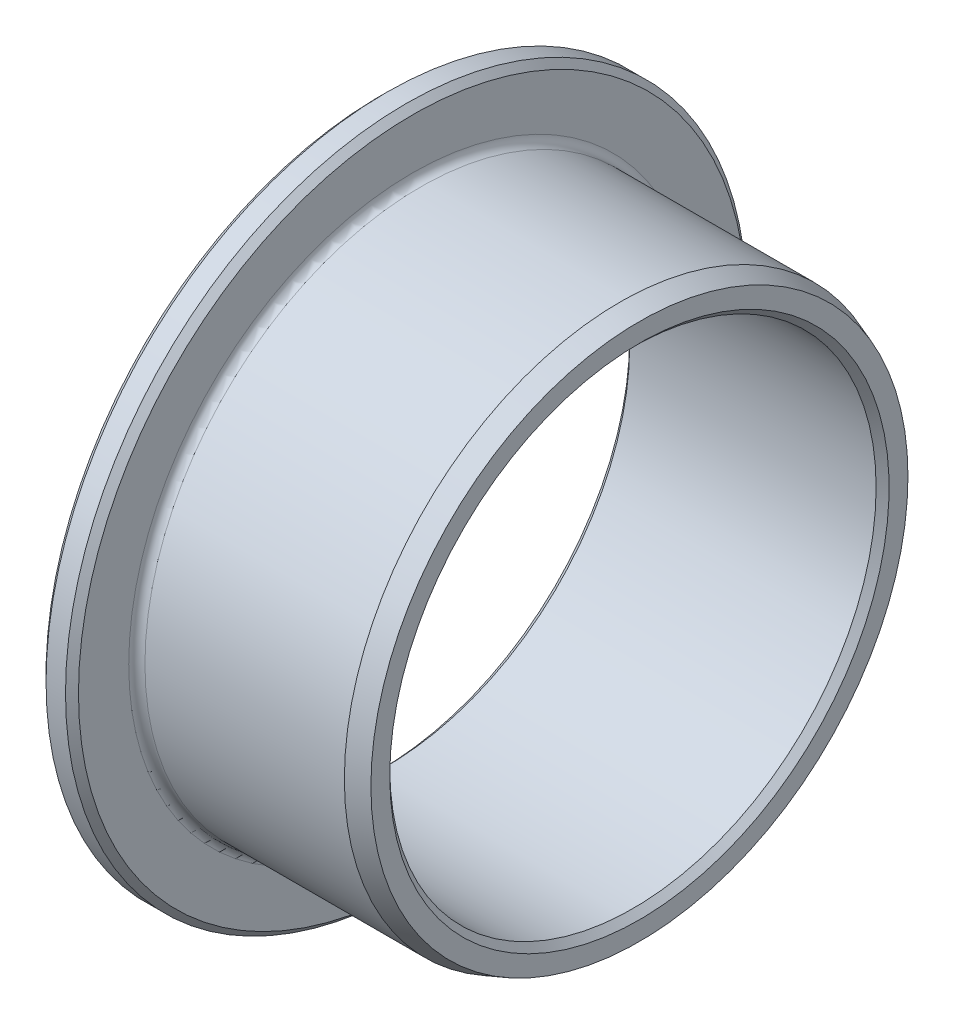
from build123d import *

# Parameters (mm, degrees)
CONG_2_R         = 0.5
CHANFREIN1_SIZE  = 0.4
CHANFREIN3_SIZE  = 1.2
CHANFREIN3_SIZE2 = 0.436764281


with BuildPart() as part:
    # Esquisse1 → Base-R_volution (revolve)
    with BuildSketch(Plane.XY, mode=Mode.PRIVATE) as base_r_volution_sk:
        Polygon((-2, 15), (-2, 21), (0, 21), (0, 17), (14, 17), (14, 15), align=None)
    revolve(base_r_volution_sk.sketch.rotate(Axis((-5.312682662, 0, 0), (1, 0, 0)), 90), axis=Axis((-5.312682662, 0, 0), (1, 0, 0)))

    # Cong_2
    cong_2_edges = [part.edges().sort_by_distance(p)[0] for p in [
        (0, 0, -17),
    ]]
    fillet(cong_2_edges, radius=CONG_2_R)

    # Chanfrein1
    chanfrein1_edges = [part.edges().sort_by_distance(p)[0] for p in [
        (0, 0, -21),
        (-2, 0, -21),
        (-2, 0, -15),
        (14, 0, -15),
    ]]
    chamfer(chanfrein1_edges, length=CHANFREIN1_SIZE)

    # Chanfrein3
    chanfrein3_edges = [part.edges().sort_by_distance(p)[0] for p in [
        (14, 0, -17),
    ]]
    chanfrein3_side = [part.faces().sort_by_distance(p)[0] for p in [
        (7.25, 0, -17),
    ]]
    chamfer(chanfrein3_edges, length=CHANFREIN3_SIZE, length2=CHANFREIN3_SIZE2, reference=chanfrein3_side[0])


solid = part.part
